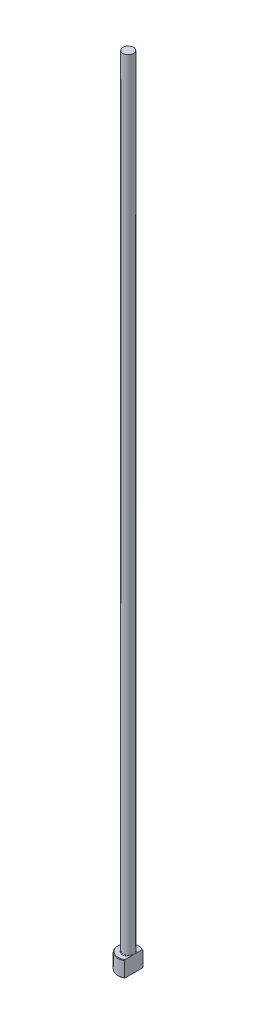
ISO-10303-21;
HEADER;
FILE_DESCRIPTION(('STEP AP214'),'2;1');
FILE_NAME('part.step','',(''),(''),'','','');
FILE_SCHEMA(('AUTOMOTIVE_DESIGN { 1 0 10303 214 1 1 1 1 }'));
ENDSEC;
DATA;
#1=APPLICATION_CONTEXT('core data for automotive mechanical design processes');
#2=APPLICATION_PROTOCOL_DEFINITION('international standard','automotive_design',2000,#1);
#3=PRODUCT_CONTEXT('',#1,'mechanical');
#4=PRODUCT('Part','Part','',(#3));
#5=PRODUCT_RELATED_PRODUCT_CATEGORY('part','',(#4));
#6=PRODUCT_DEFINITION_FORMATION('','',#4);
#7=PRODUCT_DEFINITION_CONTEXT('part definition',#1,'design');
#8=PRODUCT_DEFINITION('design','',#6,#7);
#9=PRODUCT_DEFINITION_SHAPE('','',#8);
#10=(LENGTH_UNIT() NAMED_UNIT(*) SI_UNIT(.MILLI.,.METRE.));
#11=(NAMED_UNIT(*) PLANE_ANGLE_UNIT() SI_UNIT($,.RADIAN.));
#12=(NAMED_UNIT(*) SI_UNIT($,.STERADIAN.) SOLID_ANGLE_UNIT());
#13=UNCERTAINTY_MEASURE_WITH_UNIT(LENGTH_MEASURE(1.E-05),#10,'distance_accuracy_value','');
#14=(GEOMETRIC_REPRESENTATION_CONTEXT(3) GLOBAL_UNCERTAINTY_ASSIGNED_CONTEXT((#13)) GLOBAL_UNIT_ASSIGNED_CONTEXT((#10,
#11,#12)) REPRESENTATION_CONTEXT('',''));
#15=CARTESIAN_POINT('',(0.,0.,0.));
#16=DIRECTION('',(0.,0.,1.));
#17=DIRECTION('',(1.,0.,0.));
#18=AXIS2_PLACEMENT_3D('',#15,#16,#17);
#19=CARTESIAN_POINT('',(0.,0.,0.));
#20=DIRECTION('',(0.,-1.,0.));
#21=DIRECTION('',(0.,0.,-1.));
#22=AXIS2_PLACEMENT_3D('',#19,#20,#21);
#23=PLANE('',#22);
#24=CARTESIAN_POINT('',(0.,0.,0.));
#25=DIRECTION('',(0.,-1.,0.));
#26=DIRECTION('',(0.,0.,-1.));
#27=AXIS2_PLACEMENT_3D('',#24,#25,#26);
#28=CIRCLE('',#27,3.79999999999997);
#29=CARTESIAN_POINT('',(1.99999999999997,0.,3.23109888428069));
#30=VERTEX_POINT('',#29);
#31=CARTESIAN_POINT('',(1.99999999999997,0.,-3.23109888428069));
#32=VERTEX_POINT('',#31);
#33=EDGE_CURVE('E98',#30,#32,#28,.T.);
#34=ORIENTED_EDGE('',*,*,#33,.T.);
#35=DIRECTION('',(0.,0.,1.));
#36=VECTOR('',#35,1.);
#37=CARTESIAN_POINT('',(1.99999999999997,0.,3.46410161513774));
#38=LINE('',#37,#36);
#39=EDGE_CURVE('E83',#32,#30,#38,.T.);
#40=ORIENTED_EDGE('',*,*,#39,.T.);
#41=EDGE_LOOP('',(#34,#40));
#42=FACE_BOUND('',#41,.T.);
#43=ADVANCED_FACE('F32',(#42),#23,.T.);
#44=CARTESIAN_POINT('',(0.,259.958771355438,0.));
#45=DIRECTION('',(0.,1.,0.));
#46=DIRECTION('',(0.,0.,1.));
#47=AXIS2_PLACEMENT_3D('',#44,#45,#46);
#48=CYLINDRICAL_SURFACE('',#47,3.99999999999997);
#49=CARTESIAN_POINT('',(0.,5.80000000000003,0.));
#50=DIRECTION('',(0.,1.,0.));
#51=DIRECTION('',(0.,0.,1.));
#52=AXIS2_PLACEMENT_3D('',#49,#50,#51);
#53=CIRCLE('',#52,3.99999999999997);
#54=CARTESIAN_POINT('',(1.99999999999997,5.80000000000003,3.46410161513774));
#55=VERTEX_POINT('',#54);
#56=CARTESIAN_POINT('',(1.99999999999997,5.80000000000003,-3.46410161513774));
#57=VERTEX_POINT('',#56);
#58=EDGE_CURVE('E104',#55,#57,#53,.F.);
#59=ORIENTED_EDGE('',*,*,#58,.T.);
#60=DIRECTION('',(0.,-1.,0.));
#61=VECTOR('',#60,1.);
#62=CARTESIAN_POINT('',(1.99999999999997,300.,-3.46410161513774));
#63=LINE('',#62,#61);
#64=CARTESIAN_POINT('',(1.99999999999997,0.199999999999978,-3.46410161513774));
#65=VERTEX_POINT('',#64);
#66=EDGE_CURVE('E183',#57,#65,#63,.T.);
#67=ORIENTED_EDGE('',*,*,#66,.T.);
#68=CARTESIAN_POINT('',(0.,0.199999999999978,0.));
#69=DIRECTION('',(0.,-1.,0.));
#70=DIRECTION('',(0.,0.,-1.));
#71=AXIS2_PLACEMENT_3D('',#68,#69,#70);
#72=CIRCLE('',#71,3.99999999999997);
#73=CARTESIAN_POINT('',(1.99999999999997,0.199999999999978,3.46410161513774));
#74=VERTEX_POINT('',#73);
#75=EDGE_CURVE('E100',#65,#74,#72,.F.);
#76=ORIENTED_EDGE('',*,*,#75,.T.);
#77=DIRECTION('',(0.,-1.,0.));
#78=VECTOR('',#77,1.);
#79=CARTESIAN_POINT('',(1.99999999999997,300.,3.46410161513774));
#80=LINE('',#79,#78);
#81=EDGE_CURVE('E93',#55,#74,#80,.T.);
#82=ORIENTED_EDGE('',*,*,#81,.F.);
#83=EDGE_LOOP('',(#59,#67,#76,#82));
#84=FACE_BOUND('',#83,.T.);
#85=ADVANCED_FACE('F158',(#84),#48,.T.);
#86=CARTESIAN_POINT('',(-3.99999999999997,6.,0.));
#87=DIRECTION('',(0.,1.,0.));
#88=DIRECTION('',(0.,0.,1.));
#89=AXIS2_PLACEMENT_3D('',#86,#87,#88);
#90=PLANE('',#89);
#91=CARTESIAN_POINT('',(0.,6.,0.));
#92=DIRECTION('',(0.,1.,0.));
#93=DIRECTION('',(0.,0.,1.));
#94=AXIS2_PLACEMENT_3D('',#91,#92,#93);
#95=CIRCLE('',#94,3.8);
#96=CARTESIAN_POINT('',(1.99999999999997,6.,-3.23109888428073));
#97=VERTEX_POINT('',#96);
#98=CARTESIAN_POINT('',(1.99999999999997,6.,3.23109888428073));
#99=VERTEX_POINT('',#98);
#100=EDGE_CURVE('E178',#97,#99,#95,.T.);
#101=ORIENTED_EDGE('',*,*,#100,.T.);
#102=DIRECTION('',(0.,0.,-1.));
#103=VECTOR('',#102,1.);
#104=CARTESIAN_POINT('',(1.99999999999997,6.,0.));
#105=LINE('',#104,#103);
#106=CARTESIAN_POINT('',(1.99999999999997,5.99999999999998,0.916515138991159));
#107=VERTEX_POINT('',#106);
#108=EDGE_CURVE('E57',#99,#107,#105,.T.);
#109=ORIENTED_EDGE('',*,*,#108,.T.);
#110=CARTESIAN_POINT('',(0.,6.,0.));
#111=DIRECTION('',(0.,1.,0.));
#112=DIRECTION('',(0.,0.,1.));
#113=AXIS2_PLACEMENT_3D('',#110,#111,#112);
#114=CIRCLE('',#113,2.19999999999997);
#115=CARTESIAN_POINT('',(1.99999999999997,5.99999999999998,-0.916515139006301));
#116=VERTEX_POINT('',#115);
#117=EDGE_CURVE('E107',#107,#116,#114,.F.);
#118=ORIENTED_EDGE('',*,*,#117,.T.);
#119=EDGE_CURVE('E136',#116,#97,#105,.T.);
#120=ORIENTED_EDGE('',*,*,#119,.T.);
#121=EDGE_LOOP('',(#101,#109,#118,#120));
#122=FACE_BOUND('',#121,.T.);
#123=ADVANCED_FACE('F147',(#122),#90,.T.);
#124=CARTESIAN_POINT('',(0.,6.00000000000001,0.));
#125=DIRECTION('',(0.,-1.,0.));
#126=DIRECTION('',(0.,0.,-1.));
#127=AXIS2_PLACEMENT_3D('',#124,#125,#126);
#128=CONICAL_SURFACE('',#127,3.8,0.785398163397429);
#129=ORIENTED_EDGE('',*,*,#58,.F.);
#130=CARTESIAN_POINT('',(1.99999999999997,1.91904532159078,7.62295524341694));
#131=CARTESIAN_POINT('',(1.99999999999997,2.08611243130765,7.45022392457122));
#132=CARTESIAN_POINT('',(1.99999999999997,2.25300024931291,7.27731861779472));
#133=CARTESIAN_POINT('',(1.99999999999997,2.58631125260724,6.9310565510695));
#134=CARTESIAN_POINT('',(1.99999999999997,2.752734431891,6.75769978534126));
#135=CARTESIAN_POINT('',(1.99999999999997,3.08509080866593,6.41034692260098));
#136=CARTESIAN_POINT('',(1.99999999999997,3.25102371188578,6.23635054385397));
#137=CARTESIAN_POINT('',(1.99999999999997,3.58215598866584,5.88766284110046));
#138=CARTESIAN_POINT('',(1.99999999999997,3.74735536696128,5.71297152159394));
#139=CARTESIAN_POINT('',(1.99999999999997,4.07353855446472,5.36616839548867));
#140=CARTESIAN_POINT('',(1.99999999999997,4.23454099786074,5.19407412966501));
#141=CARTESIAN_POINT('',(1.99999999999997,4.55534102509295,4.84876663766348));
#142=CARTESIAN_POINT('',(1.99999999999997,4.71513861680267,4.67555341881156));
#143=CARTESIAN_POINT('',(1.99999999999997,5.03306183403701,4.32766569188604));
#144=CARTESIAN_POINT('',(1.99999999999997,5.19118781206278,4.15299150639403));
#145=CARTESIAN_POINT('',(1.99999999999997,5.50513944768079,3.80159134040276));
#146=CARTESIAN_POINT('',(1.99999999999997,5.66096519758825,3.62486544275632));
#147=CARTESIAN_POINT('',(1.99999999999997,5.90974646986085,3.33722425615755));
#148=CARTESIAN_POINT('',(1.99999999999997,6.00376148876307,3.22722645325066));
#149=CARTESIAN_POINT('',(1.99999999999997,6.19011825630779,3.00579987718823));
#150=CARTESIAN_POINT('',(1.99999999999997,6.28245983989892,2.8943709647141));
#151=CARTESIAN_POINT('',(1.99999999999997,6.46586188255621,2.66849662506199));
#152=CARTESIAN_POINT('',(1.99999999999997,6.5568984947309,2.55403176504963));
#153=CARTESIAN_POINT('',(1.99999999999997,6.7357880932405,2.32266819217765));
#154=CARTESIAN_POINT('',(1.99999999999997,6.82364184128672,2.20577007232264));
#155=CARTESIAN_POINT('',(1.99999999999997,6.9961275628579,1.9668870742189));
#156=CARTESIAN_POINT('',(1.99999999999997,7.08069035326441,1.84485190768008));
#157=CARTESIAN_POINT('',(1.99999999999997,7.24300264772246,1.59599329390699));
#158=CARTESIAN_POINT('',(1.99999999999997,7.32074277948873,1.46916359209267));
#159=CARTESIAN_POINT('',(1.99999999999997,7.4286976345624,1.27510066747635));
#160=CARTESIAN_POINT('',(1.99999999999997,7.46305374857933,1.21018943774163));
#161=CARTESIAN_POINT('',(1.99999999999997,7.5283714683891,1.07868835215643));
#162=CARTESIAN_POINT('',(1.99999999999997,7.55933245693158,1.01209819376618));
#163=CARTESIAN_POINT('',(1.99999999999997,7.64566860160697,0.809894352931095));
#164=CARTESIAN_POINT('',(1.99999999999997,7.6947821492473,0.671360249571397));
#165=CARTESIAN_POINT('',(1.99999999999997,7.74794829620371,0.463657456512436));
#166=CARTESIAN_POINT('',(1.99999999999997,7.76205065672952,0.397033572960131));
#167=CARTESIAN_POINT('',(1.99999999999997,7.78390371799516,0.262728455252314));
#168=CARTESIAN_POINT('',(1.99999999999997,7.79165498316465,0.195047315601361));
#169=CARTESIAN_POINT('',(1.99999999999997,7.8002569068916,0.0594528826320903));
#170=CARTESIAN_POINT('',(1.99999999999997,7.80112894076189,-0.00845903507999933));
#171=CARTESIAN_POINT('',(1.99999999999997,7.79596585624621,-0.144020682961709));
#172=CARTESIAN_POINT('',(1.99999999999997,7.78993016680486,-0.211670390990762));
#173=CARTESIAN_POINT('',(1.99999999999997,7.77145363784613,-0.345483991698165));
#174=CARTESIAN_POINT('',(1.99999999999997,7.75906777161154,-0.41165563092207));
#175=CARTESIAN_POINT('',(1.99999999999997,7.72866360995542,-0.542678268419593));
#176=CARTESIAN_POINT('',(1.99999999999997,7.71064463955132,-0.607529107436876));
#177=CARTESIAN_POINT('',(1.99999999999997,7.66972939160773,-0.73606439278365));
#178=CARTESIAN_POINT('',(1.99999999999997,7.64680564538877,-0.799739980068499));
#179=CARTESIAN_POINT('',(1.99999999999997,7.59700147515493,-0.925489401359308));
#180=CARTESIAN_POINT('',(1.99999999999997,7.57012185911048,-0.987563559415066));
#181=CARTESIAN_POINT('',(1.99999999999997,7.48443518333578,-1.17209020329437));
#182=CARTESIAN_POINT('',(1.99999999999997,7.42077407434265,-1.29228210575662));
#183=CARTESIAN_POINT('',(1.99999999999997,7.2850264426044,-1.52785770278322));
#184=CARTESIAN_POINT('',(1.99999999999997,7.21292931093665,-1.64323509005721));
#185=CARTESIAN_POINT('',(1.99999999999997,7.06281517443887,-1.87069387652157));
#186=CARTESIAN_POINT('',(1.99999999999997,6.98477595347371,-1.98276048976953));
#187=CARTESIAN_POINT('',(1.99999999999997,6.8248197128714,-2.20397837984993));
#188=CARTESIAN_POINT('',(1.99999999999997,6.74290465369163,-2.31313108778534));
#189=CARTESIAN_POINT('',(1.99999999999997,6.57517222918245,-2.53068545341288));
#190=CARTESIAN_POINT('',(1.99999999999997,6.48931769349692,-2.63905831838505));
#191=CARTESIAN_POINT('',(1.99999999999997,6.31548151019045,-2.85409686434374));
#192=CARTESIAN_POINT('',(1.99999999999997,6.2274996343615,-2.96076236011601));
#193=CARTESIAN_POINT('',(1.99999999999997,6.05015030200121,-3.17249211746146));
#194=CARTESIAN_POINT('',(1.99999999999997,5.9607867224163,-3.27755963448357));
#195=CARTESIAN_POINT('',(1.99999999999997,5.78082366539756,-3.4866319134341));
#196=CARTESIAN_POINT('',(1.99999999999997,5.69022416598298,-3.59063665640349));
#197=CARTESIAN_POINT('',(1.99999999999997,5.44796733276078,-3.86612439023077));
#198=CARTESIAN_POINT('',(1.99999999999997,5.29545972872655,-4.03685912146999));
#199=CARTESIAN_POINT('',(1.99999999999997,4.98858070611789,-4.37664803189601));
#200=CARTESIAN_POINT('',(1.99999999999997,4.83420923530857,-4.54570216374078));
#201=CARTESIAN_POINT('',(1.99999999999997,4.52396102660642,-4.88271638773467));
#202=CARTESIAN_POINT('',(1.99999999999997,4.36808300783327,-5.05067529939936));
#203=CARTESIAN_POINT('',(1.99999999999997,4.05530513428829,-5.38563883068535));
#204=CARTESIAN_POINT('',(1.99999999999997,3.89840527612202,-5.55264344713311));
#205=CARTESIAN_POINT('',(1.99999999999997,3.59029018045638,-5.87905385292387));
#206=CARTESIAN_POINT('',(1.99999999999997,3.43910664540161,-6.03848959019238));
#207=CARTESIAN_POINT('',(1.99999999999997,3.1361643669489,-6.35681456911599));
#208=CARTESIAN_POINT('',(1.99999999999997,2.98440562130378,-6.51570380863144));
#209=CARTESIAN_POINT('',(1.99999999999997,2.6805950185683,-6.83286192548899));
#210=CARTESIAN_POINT('',(1.99999999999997,2.52854367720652,-6.99113129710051));
#211=CARTESIAN_POINT('',(1.99999999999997,2.22406035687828,-7.30730102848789));
#212=CARTESIAN_POINT('',(1.99999999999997,2.07162838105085,-7.46520139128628));
#213=CARTESIAN_POINT('',(1.99999999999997,1.91904532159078,-7.62295524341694));
#214=B_SPLINE_CURVE_WITH_KNOTS('',3,(#130,#131,#132,#133,#134,#135,#136,#137,#138,#139,#140,
#141,#142,#143,#144,#145,#146,#147,#148,#149,#150,#151,#152,#153,#154,#155,#156,#157,#158,#159,
#160,#161,#162,#163,#164,#165,#166,#167,#168,#169,#170,#171,#172,#173,#174,#175,#176,#177,#178,
#179,#180,#181,#182,#183,#184,#185,#186,#187,#188,#189,#190,#191,#192,#193,#194,#195,#196,#197,
#198,#199,#200,#201,#202,#203,#204,#205,#206,#207,#208,#209,#210,#211,#212,#213),.UNSPECIFIED.,
.F.,.F.,(4,2,2,2,2,2,2,2,2,2,2,2,2,2,2,2,2,2,2,2,2,2,2,2,2,2,2,2,2,2,2,2,2,2,2,2,2,2,2,2,2,4),
(0.,0.720921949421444,1.44185317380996,2.16315326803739,2.88444869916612,3.59144103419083,
4.29842874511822,5.00526427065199,5.71207135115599,6.14616174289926,6.58029471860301,
7.01901494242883,7.45762947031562,7.90290456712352,8.3487820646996,8.56901415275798,
8.78928621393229,9.22814472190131,9.43219512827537,9.63622739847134,9.8396254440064,
10.0430403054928,10.2447232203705,10.4464303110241,10.6492980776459,10.8521244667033,
11.259558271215,11.6675100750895,12.0770700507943,12.4864250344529,12.901167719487,
13.3159550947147,13.7297367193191,14.1435257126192,14.8302935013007,15.5170805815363,
16.2045145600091,16.8919508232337,17.5511045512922,18.2102608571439,18.86868195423,
19.5270976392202),.UNSPECIFIED.);
#215=EDGE_CURVE('E135',#55,#99,#214,.T.);
#216=ORIENTED_EDGE('',*,*,#215,.T.);
#217=ORIENTED_EDGE('',*,*,#100,.F.);
#218=EDGE_CURVE('E127',#97,#57,#214,.T.);
#219=ORIENTED_EDGE('',*,*,#218,.T.);
#220=EDGE_LOOP('',(#129,#216,#217,#219));
#221=FACE_BOUND('',#220,.T.);
#222=ADVANCED_FACE('F143',(#221),#128,.T.);
#223=CARTESIAN_POINT('',(0.,0.199999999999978,0.));
#224=DIRECTION('',(0.,1.,0.));
#225=DIRECTION('',(0.,0.,1.));
#226=AXIS2_PLACEMENT_3D('',#223,#224,#225);
#227=CONICAL_SURFACE('',#226,3.99999999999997,0.785398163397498);
#228=ORIENTED_EDGE('',*,*,#75,.F.);
#229=CARTESIAN_POINT('',(1.99999999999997,4.08095467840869,-7.62295524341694));
#230=CARTESIAN_POINT('',(1.99999999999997,3.91388756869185,-7.45022392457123));
#231=CARTESIAN_POINT('',(1.99999999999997,3.74699975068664,-7.27731861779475));
#232=CARTESIAN_POINT('',(1.99999999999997,3.41368874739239,-6.93105655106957));
#233=CARTESIAN_POINT('',(1.99999999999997,3.24726556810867,-6.75769978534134));
#234=CARTESIAN_POINT('',(1.99999999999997,2.91490919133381,-6.4103469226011));
#235=CARTESIAN_POINT('',(1.99999999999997,2.748976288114,-6.23635054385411));
#236=CARTESIAN_POINT('',(1.99999999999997,2.41784401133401,-5.88766284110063));
#237=CARTESIAN_POINT('',(1.99999999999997,2.25264463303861,-5.71297152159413));
#238=CARTESIAN_POINT('',(1.99999999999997,1.92646144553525,-5.36616839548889));
#239=CARTESIAN_POINT('',(1.99999999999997,1.76545900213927,-5.19407412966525));
#240=CARTESIAN_POINT('',(1.99999999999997,1.44465897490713,-4.84876663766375));
#241=CARTESIAN_POINT('',(1.99999999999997,1.28486138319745,-4.67555341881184));
#242=CARTESIAN_POINT('',(1.99999999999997,0.966938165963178,-4.32766569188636));
#243=CARTESIAN_POINT('',(1.99999999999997,0.80881218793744,-4.15299150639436));
#244=CARTESIAN_POINT('',(1.99999999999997,0.494860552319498,-3.80159134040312));
#245=CARTESIAN_POINT('',(1.99999999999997,0.339034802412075,-3.62486544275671));
#246=CARTESIAN_POINT('',(1.99999999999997,0.0902535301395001,-3.33722425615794));
#247=CARTESIAN_POINT('',(1.99999999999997,-0.00376148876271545,-3.22722645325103));
#248=CARTESIAN_POINT('',(1.99999999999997,-0.190118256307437,-3.00579987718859));
#249=CARTESIAN_POINT('',(1.99999999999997,-0.282459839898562,-2.89437096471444));
#250=CARTESIAN_POINT('',(1.99999999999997,-0.465861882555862,-2.66849662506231));
#251=CARTESIAN_POINT('',(1.99999999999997,-0.556898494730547,-2.55403176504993));
#252=CARTESIAN_POINT('',(1.99999999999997,-0.73578809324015,-2.32266819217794));
#253=CARTESIAN_POINT('',(1.99999999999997,-0.823641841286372,-2.20577007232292));
#254=CARTESIAN_POINT('',(1.99999999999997,-0.996127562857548,-1.96688707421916));
#255=CARTESIAN_POINT('',(1.99999999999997,-1.08069035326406,-1.84485190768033));
#256=CARTESIAN_POINT('',(1.99999999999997,-1.24300264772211,-1.59599329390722));
#257=CARTESIAN_POINT('',(1.99999999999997,-1.32074277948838,-1.46916359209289));
#258=CARTESIAN_POINT('',(1.99999999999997,-1.42869763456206,-1.27510066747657));
#259=CARTESIAN_POINT('',(1.99999999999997,-1.46305374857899,-1.21018943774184));
#260=CARTESIAN_POINT('',(1.99999999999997,-1.52837146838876,-1.07868835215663));
#261=CARTESIAN_POINT('',(1.99999999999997,-1.55933245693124,-1.01209819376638));
#262=CARTESIAN_POINT('',(1.99999999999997,-1.64566860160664,-0.809894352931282));
#263=CARTESIAN_POINT('',(1.99999999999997,-1.69478214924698,-0.671360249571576));
#264=CARTESIAN_POINT('',(1.99999999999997,-1.7479482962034,-0.463657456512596));
#265=CARTESIAN_POINT('',(1.99999999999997,-1.76205065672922,-0.397033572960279));
#266=CARTESIAN_POINT('',(1.99999999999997,-1.78390371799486,-0.262728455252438));
#267=CARTESIAN_POINT('',(1.99999999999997,-1.79165498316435,-0.195047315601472));
#268=CARTESIAN_POINT('',(1.99999999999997,-1.80025690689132,-0.0594528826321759));
#269=CARTESIAN_POINT('',(1.99999999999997,-1.8011289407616,0.00845903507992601));
#270=CARTESIAN_POINT('',(1.99999999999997,-1.79596585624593,0.144020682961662));
#271=CARTESIAN_POINT('',(1.99999999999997,-1.78993016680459,0.211670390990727));
#272=CARTESIAN_POINT('',(1.99999999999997,-1.77145363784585,0.345483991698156));
#273=CARTESIAN_POINT('',(1.99999999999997,-1.75906777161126,0.411655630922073));
#274=CARTESIAN_POINT('',(1.99999999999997,-1.72866360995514,0.542678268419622));
#275=CARTESIAN_POINT('',(1.99999999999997,-1.71064463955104,0.607529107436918));
#276=CARTESIAN_POINT('',(1.99999999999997,-1.66972939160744,0.736064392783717));
#277=CARTESIAN_POINT('',(1.99999999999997,-1.64680564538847,0.79973998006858));
#278=CARTESIAN_POINT('',(1.99999999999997,-1.59700147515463,0.925489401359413));
#279=CARTESIAN_POINT('',(1.99999999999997,-1.57012185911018,0.987563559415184));
#280=CARTESIAN_POINT('',(1.99999999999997,-1.48443518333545,1.17209020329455));
#281=CARTESIAN_POINT('',(1.99999999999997,-1.4207740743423,1.29228210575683));
#282=CARTESIAN_POINT('',(1.99999999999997,-1.28502644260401,1.52785770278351));
#283=CARTESIAN_POINT('',(1.99999999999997,-1.21292931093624,1.64323509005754));
#284=CARTESIAN_POINT('',(1.99999999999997,-1.06281517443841,1.87069387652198));
#285=CARTESIAN_POINT('',(1.99999999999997,-0.984775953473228,1.98276048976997));
#286=CARTESIAN_POINT('',(1.99999999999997,-0.82481971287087,2.20397837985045));
#287=CARTESIAN_POINT('',(1.99999999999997,-0.742904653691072,2.3131310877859));
#288=CARTESIAN_POINT('',(1.99999999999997,-0.57517222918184,2.53068545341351));
#289=CARTESIAN_POINT('',(1.99999999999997,-0.489317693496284,2.63905831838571));
#290=CARTESIAN_POINT('',(1.99999999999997,-0.315481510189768,2.85409686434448));
#291=CARTESIAN_POINT('',(1.99999999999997,-0.227499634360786,2.96076236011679));
#292=CARTESIAN_POINT('',(1.99999999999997,-0.0501503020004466,3.17249211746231));
#293=CARTESIAN_POINT('',(1.99999999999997,0.0392132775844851,3.27755963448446));
#294=CARTESIAN_POINT('',(1.99999999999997,0.219176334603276,3.48663191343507));
#295=CARTESIAN_POINT('',(1.99999999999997,0.309775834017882,3.59063665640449));
#296=CARTESIAN_POINT('',(1.99999999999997,0.552032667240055,3.86612439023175));
#297=CARTESIAN_POINT('',(1.99999999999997,0.704540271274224,4.03685912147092));
#298=CARTESIAN_POINT('',(1.99999999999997,1.01141929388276,4.37664803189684));
#299=CARTESIAN_POINT('',(1.99999999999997,1.16579076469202,4.54570216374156));
#300=CARTESIAN_POINT('',(1.99999999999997,1.47603897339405,4.88271638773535));
#301=CARTESIAN_POINT('',(1.99999999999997,1.63191699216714,5.0506752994));
#302=CARTESIAN_POINT('',(1.99999999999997,1.94469486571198,5.3856388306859));
#303=CARTESIAN_POINT('',(1.99999999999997,2.10159472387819,5.55264344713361));
#304=CARTESIAN_POINT('',(1.99999999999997,2.40970981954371,5.87905385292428));
#305=CARTESIAN_POINT('',(1.99999999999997,2.56089335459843,6.03848959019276));
#306=CARTESIAN_POINT('',(1.99999999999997,2.86383563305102,6.35681456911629));
#307=CARTESIAN_POINT('',(1.99999999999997,3.01559437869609,6.5157038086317));
#308=CARTESIAN_POINT('',(1.99999999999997,3.31940498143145,6.83286192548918));
#309=CARTESIAN_POINT('',(1.99999999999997,3.47145632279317,6.99113129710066));
#310=CARTESIAN_POINT('',(1.99999999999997,3.77593964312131,7.30730102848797));
#311=CARTESIAN_POINT('',(1.99999999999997,3.92837161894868,7.46520139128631));
#312=CARTESIAN_POINT('',(1.99999999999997,4.08095467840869,7.62295524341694));
#313=B_SPLINE_CURVE_WITH_KNOTS('',3,(#229,#230,#231,#232,#233,#234,#235,#236,#237,#238,#239,
#240,#241,#242,#243,#244,#245,#246,#247,#248,#249,#250,#251,#252,#253,#254,#255,#256,#257,#258,
#259,#260,#261,#262,#263,#264,#265,#266,#267,#268,#269,#270,#271,#272,#273,#274,#275,#276,#277,
#278,#279,#280,#281,#282,#283,#284,#285,#286,#287,#288,#289,#290,#291,#292,#293,#294,#295,#296,
#297,#298,#299,#300,#301,#302,#303,#304,#305,#306,#307,#308,#309,#310,#311,#312),.UNSPECIFIED.,
.F.,.F.,(4,2,2,2,2,2,2,2,2,2,2,2,2,2,2,2,2,2,2,2,2,2,2,2,2,2,2,2,2,2,2,2,2,2,2,2,2,2,2,2,2,4),
(0.,0.720921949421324,1.44185317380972,2.16315326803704,2.88444869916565,3.59144103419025,
4.29842874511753,5.0052642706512,5.71207135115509,6.14616174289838,6.58029471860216,
7.01901494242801,7.45762947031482,7.90290456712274,8.34878206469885,8.56901415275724,
8.78928621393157,9.22814472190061,9.43219512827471,9.63622739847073,9.83962544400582,
10.0430403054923,10.24472322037,10.4464303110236,10.6492980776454,10.852124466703,
11.2595582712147,11.6675100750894,12.0770700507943,12.4864250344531,12.9011677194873,
13.3159550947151,13.7297367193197,14.1435257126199,14.8302935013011,15.5170805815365,
16.204514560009,16.8919508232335,17.5511045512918,18.2102608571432,18.8686819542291,
19.5270976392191),.UNSPECIFIED.);
#314=EDGE_CURVE('E86',#65,#32,#313,.T.);
#315=ORIENTED_EDGE('',*,*,#314,.T.);
#316=ORIENTED_EDGE('',*,*,#33,.F.);
#317=EDGE_CURVE('E89',#30,#74,#313,.T.);
#318=ORIENTED_EDGE('',*,*,#317,.T.);
#319=EDGE_LOOP('',(#228,#315,#316,#318));
#320=FACE_BOUND('',#319,.T.);
#321=ADVANCED_FACE('F97',(#320),#227,.T.);
#322=CARTESIAN_POINT('',(0.,6.19999999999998,0.));
#323=DIRECTION('',(0.,1.,0.));
#324=DIRECTION('',(0.,0.,1.));
#325=AXIS2_PLACEMENT_3D('',#322,#323,#324);
#326=TOROIDAL_SURFACE('',#325,2.19999999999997,0.2);
#327=CARTESIAN_POINT('',(1.99999999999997,6.19999999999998,0.));
#328=CARTESIAN_POINT('',(1.99999999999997,6.20000050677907,1.13930141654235E-10));
#329=CARTESIAN_POINT('',(1.99999999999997,6.20000101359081,-1.46766795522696E-07));
#330=CARTESIAN_POINT('',(1.99999999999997,6.20000197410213,-5.82067451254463E-07));
#331=CARTESIAN_POINT('',(1.99999999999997,6.20000242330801,-8.77873018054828E-07));
#332=CARTESIAN_POINT('',(1.99999999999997,6.2000033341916,-1.5842451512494E-06));
#333=CARTESIAN_POINT('',(1.99999999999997,6.20000378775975,-2.00534283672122E-06));
#334=CARTESIAN_POINT('',(1.99999999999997,6.20000462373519,-2.89558841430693E-06));
#335=CARTESIAN_POINT('',(1.99999999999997,6.20000500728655,-3.36372325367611E-06));
#336=CARTESIAN_POINT('',(1.99999999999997,6.20000636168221,-5.10887550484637E-06));
#337=CARTESIAN_POINT('',(1.99999999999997,6.20000725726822,-6.44597279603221E-06));
#338=CARTESIAN_POINT('',(1.99999999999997,6.20000879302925,-9.14926716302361E-06));
#339=CARTESIAN_POINT('',(1.99999999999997,6.20000944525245,-1.0508971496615E-05));
#340=CARTESIAN_POINT('',(1.99999999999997,6.20001204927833,-1.60555880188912E-05));
#341=CARTESIAN_POINT('',(1.99999999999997,6.20001390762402,-2.02908747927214E-05));
#342=CARTESIAN_POINT('',(1.99999999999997,6.20001676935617,-2.84438494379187E-05));
#343=CARTESIAN_POINT('',(1.99999999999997,6.20001785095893,-3.23343259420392E-05));
#344=CARTESIAN_POINT('',(1.99999999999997,6.20002551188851,-6.06027145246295E-05));
#345=CARTESIAN_POINT('',(1.99999999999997,6.20003111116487,-8.51991847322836E-05));
#346=CARTESIAN_POINT('',(1.99999999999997,6.20005559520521,-0.00018156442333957));
#347=CARTESIAN_POINT('',(1.99999999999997,6.20007914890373,-0.000252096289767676));
#348=CARTESIAN_POINT('',(1.99999999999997,6.20017002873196,-0.00052958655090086));
#349=CARTESIAN_POINT('',(1.99999999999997,6.20023415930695,-0.00073729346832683));
#350=CARTESIAN_POINT('',(1.99999999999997,6.20048926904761,-0.00155657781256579));
#351=CARTESIAN_POINT('',(1.99999999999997,6.20068414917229,-0.00216722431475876));
#352=CARTESIAN_POINT('',(1.99999999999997,6.20148805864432,-0.0046938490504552));
#353=CARTESIAN_POINT('',(1.99999999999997,6.20209226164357,-0.00661098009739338));
#354=CARTESIAN_POINT('',(1.99999999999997,6.20822779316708,-0.026069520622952));
#355=CARTESIAN_POINT('',(1.99999999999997,6.21378174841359,-0.0436057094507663));
#356=CARTESIAN_POINT('',(1.99999999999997,6.22462834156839,-0.0780127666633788));
#357=CARTESIAN_POINT('',(1.99999999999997,6.22992277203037,-0.0948831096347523));
#358=CARTESIAN_POINT('',(1.99999999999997,6.24110477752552,-0.130713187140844));
#359=CARTESIAN_POINT('',(1.99999999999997,6.24698536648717,-0.149675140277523));
#360=CARTESIAN_POINT('',(1.99999999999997,6.25869835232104,-0.187834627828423));
#361=CARTESIAN_POINT('',(1.99999999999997,6.26452957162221,-0.207032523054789));
#362=CARTESIAN_POINT('',(1.99999999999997,6.27861584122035,-0.254071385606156));
#363=CARTESIAN_POINT('',(1.99999999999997,6.28678835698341,-0.281937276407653));
#364=CARTESIAN_POINT('',(1.99999999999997,6.30249503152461,-0.33711523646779));
#365=CARTESIAN_POINT('',(1.99999999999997,6.31003989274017,-0.364424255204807));
#366=CARTESIAN_POINT('',(1.99999999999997,6.32554795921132,-0.422841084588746));
#367=CARTESIAN_POINT('',(1.99999999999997,6.33343288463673,-0.453970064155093));
#368=CARTESIAN_POINT('',(1.99999999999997,6.34833120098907,-0.516667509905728));
#369=CARTESIAN_POINT('',(1.99999999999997,6.3553379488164,-0.548237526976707));
#370=CARTESIAN_POINT('',(1.99999999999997,6.37554978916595,-0.647984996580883));
#371=CARTESIAN_POINT('',(1.99999999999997,6.38665117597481,-0.716635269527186));
#372=CARTESIAN_POINT('',(1.99999999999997,6.39785773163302,-0.8324457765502));
#373=CARTESIAN_POINT('',(1.99999999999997,6.40036304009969,-0.879345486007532));
#374=CARTESIAN_POINT('',(1.99999999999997,6.39976024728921,-0.949238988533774));
#375=CARTESIAN_POINT('',(1.99999999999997,6.39886048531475,-0.97224857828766));
#376=CARTESIAN_POINT('',(1.99999999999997,6.39534463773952,-1.01812773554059));
#377=CARTESIAN_POINT('',(1.99999999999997,6.39273014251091,-1.04099741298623));
#378=CARTESIAN_POINT('',(1.99999999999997,6.38623968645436,-1.08102660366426));
#379=CARTESIAN_POINT('',(1.99999999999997,6.38280841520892,-1.09825717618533));
#380=CARTESIAN_POINT('',(1.99999999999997,6.37442567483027,-1.13243508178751));
#381=CARTESIAN_POINT('',(1.99999999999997,6.36946777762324,-1.14938089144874));
#382=CARTESIAN_POINT('',(1.99999999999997,6.35764172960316,-1.18276398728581));
#383=CARTESIAN_POINT('',(1.99999999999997,6.35075810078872,-1.1991959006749));
#384=CARTESIAN_POINT('',(1.99999999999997,6.33462082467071,-1.23083581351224));
#385=CARTESIAN_POINT('',(1.99999999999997,6.32537783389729,-1.24604892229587));
#386=CARTESIAN_POINT('',(1.99999999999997,6.30929159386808,-1.26715296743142));
#387=CARTESIAN_POINT('',(1.99999999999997,6.303567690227,-1.27389441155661));
#388=CARTESIAN_POINT('',(1.99999999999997,6.29128925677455,-1.28659894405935));
#389=CARTESIAN_POINT('',(1.99999999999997,6.28473413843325,-1.29256147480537));
#390=CARTESIAN_POINT('',(1.99999999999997,6.27066594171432,-1.30346436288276));
#391=CARTESIAN_POINT('',(1.99999999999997,6.26314132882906,-1.30839014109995));
#392=CARTESIAN_POINT('',(1.99999999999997,6.24727957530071,-1.31668687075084));
#393=CARTESIAN_POINT('',(1.99999999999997,6.23894498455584,-1.32006252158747));
#394=CARTESIAN_POINT('',(1.99999999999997,6.22424089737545,-1.3241557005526));
#395=CARTESIAN_POINT('',(1.99999999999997,6.21800630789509,-1.32536112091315));
#396=CARTESIAN_POINT('',(1.99999999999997,6.20542266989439,-1.32669615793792));
#397=CARTESIAN_POINT('',(1.99999999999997,6.19907368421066,-1.32682634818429));
#398=CARTESIAN_POINT('',(1.99999999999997,6.18645152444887,-1.32599950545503));
#399=CARTESIAN_POINT('',(1.99999999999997,6.18017831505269,-1.32504300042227));
#400=CARTESIAN_POINT('',(1.99999999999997,6.16787181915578,-1.32212308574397));
#401=CARTESIAN_POINT('',(1.99999999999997,6.16183869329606,-1.32015901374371));
#402=CARTESIAN_POINT('',(1.99999999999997,6.14844260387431,-1.31466566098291));
#403=CARTESIAN_POINT('',(1.99999999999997,6.14119825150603,-1.3108482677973));
#404=CARTESIAN_POINT('',(1.99999999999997,6.12742328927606,-1.30209252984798));
#405=CARTESIAN_POINT('',(1.99999999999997,6.12089414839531,-1.29715193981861));
#406=CARTESIAN_POINT('',(1.99999999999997,6.10554761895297,-1.28382084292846));
#407=CARTESIAN_POINT('',(1.99999999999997,6.09717242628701,-1.27492468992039));
#408=CARTESIAN_POINT('',(1.99999999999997,6.08188323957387,-1.25597903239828));
#409=CARTESIAN_POINT('',(1.99999999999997,6.07497120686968,-1.24592800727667));
#410=CARTESIAN_POINT('',(1.99999999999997,6.05771073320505,-1.21734573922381));
#411=CARTESIAN_POINT('',(1.99999999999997,6.04862251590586,-1.19806017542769));
#412=CARTESIAN_POINT('',(1.99999999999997,6.03323781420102,-1.15830155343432));
#413=CARTESIAN_POINT('',(1.99999999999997,6.02696471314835,-1.13782009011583));
#414=CARTESIAN_POINT('',(1.99999999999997,6.01659159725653,-1.09607450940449));
#415=CARTESIAN_POINT('',(1.99999999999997,6.01251776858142,-1.07480405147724));
#416=CARTESIAN_POINT('',(1.99999999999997,6.0061890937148,-1.03196822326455));
#417=CARTESIAN_POINT('',(1.99999999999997,6.00393768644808,-1.0104023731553));
#418=CARTESIAN_POINT('',(1.99999999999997,5.99950887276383,-0.946948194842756));
#419=CARTESIAN_POINT('',(1.99999999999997,5.99937097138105,-0.904921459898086));
#420=CARTESIAN_POINT('',(1.99999999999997,6.00391139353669,-0.800067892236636));
#421=CARTESIAN_POINT('',(1.99999999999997,6.01103947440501,-0.737378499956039));
#422=CARTESIAN_POINT('',(1.99999999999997,6.0310998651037,-0.61144432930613));
#423=CARTESIAN_POINT('',(1.99999999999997,6.04417074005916,-0.54822386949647));
#424=CARTESIAN_POINT('',(1.99999999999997,6.06920011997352,-0.442888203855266));
#425=CARTESIAN_POINT('',(1.99999999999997,6.08016343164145,-0.400527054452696));
#426=CARTESIAN_POINT('',(1.99999999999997,6.10315303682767,-0.316588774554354));
#427=CARTESIAN_POINT('',(1.99999999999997,6.11516655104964,-0.275008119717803));
#428=CARTESIAN_POINT('',(1.99999999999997,6.13853403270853,-0.196672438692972));
#429=CARTESIAN_POINT('',(1.99999999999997,6.14981294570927,-0.159894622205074));
#430=CARTESIAN_POINT('',(1.99999999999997,6.17316886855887,-0.0849211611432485));
#431=CARTESIAN_POINT('',(1.99999999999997,6.18525959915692,-0.046729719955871));
#432=CARTESIAN_POINT('',(1.99999999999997,6.1979086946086,-0.00660765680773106));
#433=CARTESIAN_POINT('',(1.99999999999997,6.19851400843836,-0.00468723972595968));
#434=CARTESIAN_POINT('',(1.99999999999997,6.199318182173,-0.00215985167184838));
#435=CARTESIAN_POINT('',(1.99999999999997,6.19951225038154,-0.0015517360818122));
#436=CARTESIAN_POINT('',(1.99999999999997,6.19976637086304,-0.000735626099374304));
#437=CARTESIAN_POINT('',(1.99999999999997,6.19983030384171,-0.000528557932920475));
#438=CARTESIAN_POINT('',(1.99999999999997,6.19992094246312,-0.00025181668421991));
#439=CARTESIAN_POINT('',(1.99999999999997,6.1999444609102,-0.000181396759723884));
#440=CARTESIAN_POINT('',(1.99999999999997,6.19996891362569,-8.51622338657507E-05));
#441=CARTESIAN_POINT('',(1.99999999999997,6.19997450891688,-6.05824645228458E-05));
#442=CARTESIAN_POINT('',(1.99999999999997,6.19998216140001,-3.23308902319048E-05));
#443=CARTESIAN_POINT('',(1.99999999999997,6.19998324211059,-2.8441435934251E-05));
#444=CARTESIAN_POINT('',(1.99999999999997,6.19998610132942,-2.02904710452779E-05));
#445=CARTESIAN_POINT('',(1.99999999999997,6.19998795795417,-1.6056119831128E-05));
#446=CARTESIAN_POINT('',(1.99999999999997,6.19999055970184,-1.05104411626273E-05));
#447=CARTESIAN_POINT('',(1.99999999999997,6.19999121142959,-9.15081317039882E-06));
#448=CARTESIAN_POINT('',(1.99999999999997,6.19999274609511,-6.44758195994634E-06));
#449=CARTESIAN_POINT('',(1.99999999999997,6.19999364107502,-5.11046373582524E-06));
#450=CARTESIAN_POINT('',(1.99999999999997,6.1999949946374,-3.36517635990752E-06));
#451=CARTESIAN_POINT('',(1.99999999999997,6.19999537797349,-2.8969795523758E-06));
#452=CARTESIAN_POINT('',(1.99999999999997,6.19999621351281,-2.00657125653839E-06));
#453=CARTESIAN_POINT('',(1.99999999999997,6.19999666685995,-1.58537196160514E-06));
#454=CARTESIAN_POINT('',(1.99999999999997,6.19999757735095,-8.78757217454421E-07));
#455=CARTESIAN_POINT('',(1.99999999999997,6.19999802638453,-5.82817893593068E-07));
#456=CARTESIAN_POINT('',(1.99999999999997,6.19999898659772,-1.47186735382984E-07));
#457=CARTESIAN_POINT('',(1.99999999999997,6.19999949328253,-1.13916285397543E-10));
#458=CARTESIAN_POINT('',(1.99999999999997,6.19999999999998,0.));
#459=B_SPLINE_CURVE_WITH_KNOTS('',3,(#327,#328,#329,#330,#331,#332,#333,#334,#335,#336,#337,
#338,#339,#340,#341,#342,#343,#344,#345,#346,#347,#348,#349,#350,#351,#352,#353,#354,#355,#356,
#357,#358,#359,#360,#361,#362,#363,#364,#365,#366,#367,#368,#369,#370,#371,#372,#373,#374,#375,
#376,#377,#378,#379,#380,#381,#382,#383,#384,#385,#386,#387,#388,#389,#390,#391,#392,#393,#394,
#395,#396,#397,#398,#399,#400,#401,#402,#403,#404,#405,#406,#407,#408,#409,#410,#411,#412,#413,
#414,#415,#416,#417,#418,#419,#420,#421,#422,#423,#424,#425,#426,#427,#428,#429,#430,#431,#432,
#433,#434,#435,#436,#437,#438,#439,#440,#441,#442,#443,#444,#445,#446,#447,#448,#449,#450,#451,
#452,#453,#454,#455,#456,#457,#458),.UNSPECIFIED.,.T.,.F.,(4,2,2,2,2,2,2,2,2,2,2,2,2,2,2,2,2,2,
2,2,2,2,2,2,2,2,2,2,2,2,2,2,2,2,2,2,2,2,2,2,2,2,2,2,2,2,2,2,2,2,2,2,2,2,2,2,2,2,2,2,2,2,2,2,2,
4),(0.,1.5236988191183E-06,3.13175174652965E-06,4.9793386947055E-06,6.79332712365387E-06,
1.16005918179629E-05,1.61211188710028E-05,2.99630983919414E-05,4.20611839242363E-05,
0.000117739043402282,0.000340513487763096,0.000992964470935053,0.00291555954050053,
0.00894623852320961,0.0641278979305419,0.117173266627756,0.176731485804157,0.23692308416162,
0.324038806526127,0.409031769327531,0.505353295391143,0.602364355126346,0.810598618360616,
0.951214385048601,1.02024793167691,1.08921754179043,1.14187257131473,1.19475241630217,
1.24807013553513,1.30115116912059,1.32762610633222,1.35411989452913,1.38096446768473,
1.40772711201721,1.42669285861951,1.44564848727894,1.46459491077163,1.48355380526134,
1.50798338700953,1.53246223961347,1.56891061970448,1.60540755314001,1.6690093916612,
1.73313017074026,1.79799846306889,1.86298887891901,1.9887768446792,2.17764082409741,
2.37115413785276,2.50240556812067,2.63223743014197,2.74764208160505,2.86781494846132,
2.87385601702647,2.8757706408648,2.87642108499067,2.87664350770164,2.87671913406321,
2.87673122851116,2.87674506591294,2.87674958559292,2.87675439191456,2.87675620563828,
2.87675805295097,2.87675966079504,2.87676118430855),.UNSPECIFIED.);
#460=CARTESIAN_POINT('',(1.99999999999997,6.19999999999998,0.));
#461=VERTEX_POINT('',#460);
#462=EDGE_CURVE('E11',#116,#461,#459,.T.);
#463=ORIENTED_EDGE('',*,*,#462,.F.);
#464=ORIENTED_EDGE('',*,*,#117,.F.);
#465=CARTESIAN_POINT('',(1.99999999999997,6.19999999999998,0.));
#466=CARTESIAN_POINT('',(1.99999999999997,6.19999949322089,-1.13930155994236E-10));
#467=CARTESIAN_POINT('',(1.99999999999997,6.19999898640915,1.46766795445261E-07));
#468=CARTESIAN_POINT('',(1.99999999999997,6.19999802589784,5.8206745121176E-07));
#469=CARTESIAN_POINT('',(1.99999999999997,6.19999757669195,8.77873018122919E-07));
#470=CARTESIAN_POINT('',(1.99999999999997,6.19999666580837,1.58424515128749E-06));
#471=CARTESIAN_POINT('',(1.99999999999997,6.19999621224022,2.00534283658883E-06));
#472=CARTESIAN_POINT('',(1.99999999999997,6.19999537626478,2.8955884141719E-06));
#473=CARTESIAN_POINT('',(1.99999999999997,6.19999499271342,3.36372325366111E-06));
#474=CARTESIAN_POINT('',(1.99999999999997,6.19999363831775,5.10887550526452E-06));
#475=CARTESIAN_POINT('',(1.99999999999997,6.19999274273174,6.44597279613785E-06));
#476=CARTESIAN_POINT('',(1.99999999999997,6.19999120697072,9.14926716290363E-06));
#477=CARTESIAN_POINT('',(1.99999999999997,6.19999055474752,1.05089714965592E-05));
#478=CARTESIAN_POINT('',(1.99999999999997,6.19998795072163,1.60555880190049E-05));
#479=CARTESIAN_POINT('',(1.99999999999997,6.19998609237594,2.02908747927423E-05));
#480=CARTESIAN_POINT('',(1.99999999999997,6.1999832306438,2.84438494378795E-05));
#481=CARTESIAN_POINT('',(1.99999999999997,6.19998214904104,3.23343259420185E-05));
#482=CARTESIAN_POINT('',(1.99999999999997,6.19997448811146,6.06027145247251E-05));
#483=CARTESIAN_POINT('',(1.99999999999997,6.1999688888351,8.51991847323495E-05));
#484=CARTESIAN_POINT('',(1.99999999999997,6.19994440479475,0.000181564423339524));
#485=CARTESIAN_POINT('',(1.99999999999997,6.19992085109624,0.000252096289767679));
#486=CARTESIAN_POINT('',(1.99999999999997,6.199829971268,0.000529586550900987));
#487=CARTESIAN_POINT('',(1.99999999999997,6.19976584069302,0.000737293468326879));
#488=CARTESIAN_POINT('',(1.99999999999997,6.19951073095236,0.00155657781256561));
#489=CARTESIAN_POINT('',(1.99999999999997,6.19931585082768,0.00216722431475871));
#490=CARTESIAN_POINT('',(1.99999999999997,6.19851194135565,0.00469384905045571));
#491=CARTESIAN_POINT('',(1.99999999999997,6.1979077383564,0.00661098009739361));
#492=CARTESIAN_POINT('',(1.99999999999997,6.19177220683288,0.0260695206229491));
#493=CARTESIAN_POINT('',(1.99999999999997,6.18621825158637,0.0436057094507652));
#494=CARTESIAN_POINT('',(1.99999999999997,6.17537165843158,0.078012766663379));
#495=CARTESIAN_POINT('',(1.99999999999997,6.1700772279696,0.0948831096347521));
#496=CARTESIAN_POINT('',(1.99999999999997,6.15889522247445,0.130713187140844));
#497=CARTESIAN_POINT('',(1.99999999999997,6.1530146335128,0.149675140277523));
#498=CARTESIAN_POINT('',(1.99999999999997,6.14130164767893,0.187834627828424));
#499=CARTESIAN_POINT('',(1.99999999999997,6.13547042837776,0.207032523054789));
#500=CARTESIAN_POINT('',(1.99999999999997,6.12138415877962,0.254071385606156));
#501=CARTESIAN_POINT('',(1.99999999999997,6.11321164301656,0.281937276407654));
#502=CARTESIAN_POINT('',(1.99999999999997,6.09750496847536,0.337115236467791));
#503=CARTESIAN_POINT('',(1.99999999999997,6.0899601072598,0.364424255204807));
#504=CARTESIAN_POINT('',(1.99999999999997,6.07445204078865,0.422841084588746));
#505=CARTESIAN_POINT('',(1.99999999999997,6.06656711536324,0.453970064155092));
#506=CARTESIAN_POINT('',(1.99999999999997,6.0516687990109,0.516667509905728));
#507=CARTESIAN_POINT('',(1.99999999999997,6.04466205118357,0.548237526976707));
#508=CARTESIAN_POINT('',(1.99999999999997,6.02445021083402,0.647984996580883));
#509=CARTESIAN_POINT('',(1.99999999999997,6.01334882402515,0.716635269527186));
#510=CARTESIAN_POINT('',(1.99999999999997,6.00214226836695,0.8324457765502));
#511=CARTESIAN_POINT('',(1.99999999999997,5.99963695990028,0.879345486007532));
#512=CARTESIAN_POINT('',(1.99999999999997,6.00023975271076,0.949238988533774));
#513=CARTESIAN_POINT('',(1.99999999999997,6.00113951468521,0.972248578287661));
#514=CARTESIAN_POINT('',(1.99999999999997,6.00465536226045,1.01812773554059));
#515=CARTESIAN_POINT('',(1.99999999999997,6.00726985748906,1.04099741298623));
#516=CARTESIAN_POINT('',(1.99999999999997,6.01376031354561,1.08102660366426));
#517=CARTESIAN_POINT('',(1.99999999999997,6.01719158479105,1.09825717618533));
#518=CARTESIAN_POINT('',(1.99999999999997,6.02557432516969,1.13243508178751));
#519=CARTESIAN_POINT('',(1.99999999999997,6.03053222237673,1.14938089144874));
#520=CARTESIAN_POINT('',(1.99999999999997,6.04235827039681,1.18276398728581));
#521=CARTESIAN_POINT('',(1.99999999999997,6.04924189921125,1.1991959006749));
#522=CARTESIAN_POINT('',(1.99999999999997,6.06537917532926,1.23083581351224));
#523=CARTESIAN_POINT('',(1.99999999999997,6.07462216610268,1.24604892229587));
#524=CARTESIAN_POINT('',(1.99999999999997,6.09070840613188,1.26715296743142));
#525=CARTESIAN_POINT('',(1.99999999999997,6.09643230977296,1.27389441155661));
#526=CARTESIAN_POINT('',(1.99999999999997,6.10871074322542,1.28659894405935));
#527=CARTESIAN_POINT('',(1.99999999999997,6.11526586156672,1.29256147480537));
#528=CARTESIAN_POINT('',(1.99999999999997,6.12933405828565,1.30346436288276));
#529=CARTESIAN_POINT('',(1.99999999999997,6.1368586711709,1.30839014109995));
#530=CARTESIAN_POINT('',(1.99999999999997,6.15272042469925,1.31668687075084));
#531=CARTESIAN_POINT('',(1.99999999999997,6.16105501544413,1.32006252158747));
#532=CARTESIAN_POINT('',(1.99999999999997,6.17575910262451,1.3241557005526));
#533=CARTESIAN_POINT('',(1.99999999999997,6.18199369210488,1.32536112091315));
#534=CARTESIAN_POINT('',(1.99999999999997,6.19457733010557,1.32669615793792));
#535=CARTESIAN_POINT('',(1.99999999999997,6.20092631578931,1.32682634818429));
#536=CARTESIAN_POINT('',(1.99999999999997,6.21354847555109,1.32599950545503));
#537=CARTESIAN_POINT('',(1.99999999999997,6.21982168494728,1.32504300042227));
#538=CARTESIAN_POINT('',(1.99999999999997,6.23212818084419,1.32212308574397));
#539=CARTESIAN_POINT('',(1.99999999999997,6.23816130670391,1.32015901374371));
#540=CARTESIAN_POINT('',(1.99999999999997,6.25155739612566,1.31466566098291));
#541=CARTESIAN_POINT('',(1.99999999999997,6.25880174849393,1.3108482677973));
#542=CARTESIAN_POINT('',(1.99999999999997,6.2725767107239,1.30209252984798));
#543=CARTESIAN_POINT('',(1.99999999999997,6.27910585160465,1.29715193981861));
#544=CARTESIAN_POINT('',(1.99999999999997,6.29445238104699,1.28382084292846));
#545=CARTESIAN_POINT('',(1.99999999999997,6.30282757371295,1.27492468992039));
#546=CARTESIAN_POINT('',(1.99999999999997,6.3181167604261,1.25597903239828));
#547=CARTESIAN_POINT('',(1.99999999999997,6.32502879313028,1.24592800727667));
#548=CARTESIAN_POINT('',(1.99999999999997,6.34228926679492,1.21734573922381));
#549=CARTESIAN_POINT('',(1.99999999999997,6.35137748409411,1.19806017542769));
#550=CARTESIAN_POINT('',(1.99999999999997,6.36676218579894,1.15830155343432));
#551=CARTESIAN_POINT('',(1.99999999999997,6.37303528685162,1.13782009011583));
#552=CARTESIAN_POINT('',(1.99999999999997,6.38340840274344,1.09607450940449));
#553=CARTESIAN_POINT('',(1.99999999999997,6.38748223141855,1.07480405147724));
#554=CARTESIAN_POINT('',(1.99999999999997,6.39381090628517,1.03196822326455));
#555=CARTESIAN_POINT('',(1.99999999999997,6.39606231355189,1.0104023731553));
#556=CARTESIAN_POINT('',(1.99999999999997,6.40049112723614,0.946948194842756));
#557=CARTESIAN_POINT('',(1.99999999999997,6.40062902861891,0.904921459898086));
#558=CARTESIAN_POINT('',(1.99999999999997,6.39608860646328,0.800067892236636));
#559=CARTESIAN_POINT('',(1.99999999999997,6.38896052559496,0.73737849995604));
#560=CARTESIAN_POINT('',(1.99999999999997,6.36890013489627,0.611444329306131));
#561=CARTESIAN_POINT('',(1.99999999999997,6.35582925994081,0.548223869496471));
#562=CARTESIAN_POINT('',(1.99999999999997,6.33079988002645,0.442888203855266));
#563=CARTESIAN_POINT('',(1.99999999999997,6.31983656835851,0.400527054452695));
#564=CARTESIAN_POINT('',(1.99999999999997,6.29684696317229,0.316588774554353));
#565=CARTESIAN_POINT('',(1.99999999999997,6.28483344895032,0.275008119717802));
#566=CARTESIAN_POINT('',(1.99999999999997,6.26146596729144,0.196672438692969));
#567=CARTESIAN_POINT('',(1.99999999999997,6.2501870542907,0.15989462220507));
#568=CARTESIAN_POINT('',(1.99999999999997,6.22683113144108,0.0849211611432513));
#569=CARTESIAN_POINT('',(1.99999999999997,6.214740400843,0.0467297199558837));
#570=CARTESIAN_POINT('',(1.99999999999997,6.20209130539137,0.00660765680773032));
#571=CARTESIAN_POINT('',(1.99999999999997,6.20148599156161,0.00468723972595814));
#572=CARTESIAN_POINT('',(1.99999999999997,6.20068181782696,0.00215985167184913));
#573=CARTESIAN_POINT('',(1.99999999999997,6.20048774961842,0.00155173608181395));
#574=CARTESIAN_POINT('',(1.99999999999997,6.20023362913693,0.000735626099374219));
#575=CARTESIAN_POINT('',(1.99999999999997,6.20016969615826,0.000528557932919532));
#576=CARTESIAN_POINT('',(1.99999999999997,6.20007905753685,0.000251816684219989));
#577=CARTESIAN_POINT('',(1.99999999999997,6.20005553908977,0.000181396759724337));
#578=CARTESIAN_POINT('',(1.99999999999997,6.20003108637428,8.51622338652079E-05));
#579=CARTESIAN_POINT('',(1.99999999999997,6.20002549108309,6.05824645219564E-05));
#580=CARTESIAN_POINT('',(1.99999999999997,6.20001783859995,3.2330890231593E-05));
#581=CARTESIAN_POINT('',(1.99999999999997,6.20001675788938,2.84414359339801E-05));
#582=CARTESIAN_POINT('',(1.99999999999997,6.20001389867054,2.02904710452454E-05));
#583=CARTESIAN_POINT('',(1.99999999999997,6.20001204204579,1.6056119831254E-05));
#584=CARTESIAN_POINT('',(1.99999999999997,6.20000944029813,1.05104411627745E-05));
#585=CARTESIAN_POINT('',(1.99999999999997,6.20000878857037,9.15081317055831E-06));
#586=CARTESIAN_POINT('',(1.99999999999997,6.20000725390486,6.44758195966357E-06));
#587=CARTESIAN_POINT('',(1.99999999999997,6.20000635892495,5.11046373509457E-06));
#588=CARTESIAN_POINT('',(1.99999999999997,6.20000500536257,3.36517636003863E-06));
#589=CARTESIAN_POINT('',(1.99999999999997,6.20000462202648,2.89697955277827E-06));
#590=CARTESIAN_POINT('',(1.99999999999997,6.20000378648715,2.00657125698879E-06));
#591=CARTESIAN_POINT('',(1.99999999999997,6.20000333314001,1.58537196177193E-06));
#592=CARTESIAN_POINT('',(1.99999999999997,6.20000242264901,8.78757217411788E-07));
#593=CARTESIAN_POINT('',(1.99999999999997,6.20000197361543,5.82817893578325E-07));
#594=CARTESIAN_POINT('',(1.99999999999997,6.20000101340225,1.47186735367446E-07));
#595=CARTESIAN_POINT('',(1.99999999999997,6.20000050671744,1.13916299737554E-10));
#596=CARTESIAN_POINT('',(1.99999999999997,6.19999999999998,0.));
#597=B_SPLINE_CURVE_WITH_KNOTS('',3,(#465,#466,#467,#468,#469,#470,#471,#472,#473,#474,#475,
#476,#477,#478,#479,#480,#481,#482,#483,#484,#485,#486,#487,#488,#489,#490,#491,#492,#493,#494,
#495,#496,#497,#498,#499,#500,#501,#502,#503,#504,#505,#506,#507,#508,#509,#510,#511,#512,#513,
#514,#515,#516,#517,#518,#519,#520,#521,#522,#523,#524,#525,#526,#527,#528,#529,#530,#531,#532,
#533,#534,#535,#536,#537,#538,#539,#540,#541,#542,#543,#544,#545,#546,#547,#548,#549,#550,#551,
#552,#553,#554,#555,#556,#557,#558,#559,#560,#561,#562,#563,#564,#565,#566,#567,#568,#569,#570,
#571,#572,#573,#574,#575,#576,#577,#578,#579,#580,#581,#582,#583,#584,#585,#586,#587,#588,#589,
#590,#591,#592,#593,#594,#595,#596),.UNSPECIFIED.,.T.,.F.,(4,2,2,2,2,2,2,2,2,2,2,2,2,2,2,2,2,2,
2,2,2,2,2,2,2,2,2,2,2,2,2,2,2,2,2,2,2,2,2,2,2,2,2,2,2,2,2,2,2,2,2,2,2,2,2,2,2,2,2,2,2,2,2,2,2,
4),(0.,1.5236988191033E-06,3.13175174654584E-06,4.97933869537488E-06,6.79332712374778E-06,
1.16005918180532E-05,1.61211188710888E-05,2.99630983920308E-05,4.20611839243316E-05,
0.000117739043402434,0.000340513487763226,0.000992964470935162,0.00291555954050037,
0.00894623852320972,0.0641278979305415,0.117173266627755,0.176731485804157,0.236923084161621,
0.324038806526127,0.409031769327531,0.505353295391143,0.602364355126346,0.810598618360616,
0.951214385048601,1.02024793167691,1.08921754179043,1.14187257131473,1.19475241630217,
1.24807013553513,1.30115116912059,1.32762610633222,1.35411989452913,1.38096446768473,
1.40772711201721,1.42669285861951,1.44564848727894,1.46459491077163,1.48355380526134,
1.50798338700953,1.53246223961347,1.56891061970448,1.60540755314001,1.6690093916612,
1.73313017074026,1.79799846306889,1.86298887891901,1.9887768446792,2.17764082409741,
2.37115413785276,2.50240556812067,2.63223743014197,2.74764208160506,2.86781494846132,
2.87385601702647,2.8757706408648,2.87642108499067,2.87664350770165,2.87671913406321,
2.87673122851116,2.87674506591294,2.87674958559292,2.87675439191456,2.87675620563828,
2.87675805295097,2.87675966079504,2.87676118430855),.UNSPECIFIED.);
#598=EDGE_CURVE('E46',#461,#107,#597,.T.);
#599=ORIENTED_EDGE('',*,*,#598,.F.);
#600=CARTESIAN_POINT('',(0.,6.19999999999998,0.));
#601=DIRECTION('',(0.,1.,0.));
#602=DIRECTION('',(0.,0.,1.));
#603=AXIS2_PLACEMENT_3D('',#600,#601,#602);
#604=CIRCLE('',#603,1.99999999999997);
#605=EDGE_CURVE('E103',#461,#461,#604,.T.);
#606=ORIENTED_EDGE('',*,*,#605,.F.);
#607=EDGE_LOOP('',(#463,#464,#599,#606));
#608=FACE_BOUND('',#607,.T.);
#609=ADVANCED_FACE('F34',(#608),#326,.F.);
#610=CARTESIAN_POINT('',(0.,259.958771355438,0.));
#611=DIRECTION('',(0.,1.,0.));
#612=DIRECTION('',(0.,0.,1.));
#613=AXIS2_PLACEMENT_3D('',#610,#611,#612);
#614=CYLINDRICAL_SURFACE('',#613,1.99999999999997);
#615=ORIENTED_EDGE('',*,*,#605,.T.);
#616=EDGE_LOOP('',(#615));
#617=FACE_BOUND('',#616,.T.);
#618=CARTESIAN_POINT('',(0.,300.,0.));
#619=DIRECTION('',(0.,1.,0.));
#620=DIRECTION('',(0.,0.,1.));
#621=AXIS2_PLACEMENT_3D('',#618,#619,#620);
#622=CIRCLE('',#621,1.99999999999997);
#623=CARTESIAN_POINT('',(0.,300.,1.99999999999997));
#624=VERTEX_POINT('',#623);
#625=EDGE_CURVE('E101',#624,#624,#622,.T.);
#626=ORIENTED_EDGE('',*,*,#625,.F.);
#627=EDGE_LOOP('',(#626));
#628=FACE_BOUND('',#627,.T.);
#629=ADVANCED_FACE('F155',(#617,#628),#614,.T.);
#630=CARTESIAN_POINT('',(-1.99999999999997,300.,0.));
#631=DIRECTION('',(0.,1.,0.));
#632=DIRECTION('',(0.,0.,1.));
#633=AXIS2_PLACEMENT_3D('',#630,#631,#632);
#634=PLANE('',#633);
#635=ORIENTED_EDGE('',*,*,#625,.T.);
#636=EDGE_LOOP('',(#635));
#637=FACE_BOUND('',#636,.T.);
#638=ADVANCED_FACE('F121',(#637),#634,.T.);
#639=CARTESIAN_POINT('',(1.99999999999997,300.,3.46410161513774));
#640=DIRECTION('',(1.,0.,0.));
#641=DIRECTION('',(0.,0.,-1.));
#642=AXIS2_PLACEMENT_3D('',#639,#640,#641);
#643=PLANE('',#642);
#644=ORIENTED_EDGE('',*,*,#66,.F.);
#645=ORIENTED_EDGE('',*,*,#218,.F.);
#646=ORIENTED_EDGE('',*,*,#119,.F.);
#647=ORIENTED_EDGE('',*,*,#462,.T.);
#648=ORIENTED_EDGE('',*,*,#598,.T.);
#649=ORIENTED_EDGE('',*,*,#108,.F.);
#650=ORIENTED_EDGE('',*,*,#215,.F.);
#651=ORIENTED_EDGE('',*,*,#81,.T.);
#652=ORIENTED_EDGE('',*,*,#317,.F.);
#653=ORIENTED_EDGE('',*,*,#39,.F.);
#654=ORIENTED_EDGE('',*,*,#314,.F.);
#655=EDGE_LOOP('',(#644,#645,#646,#647,#648,#649,#650,#651,#652,#653,#654));
#656=FACE_BOUND('',#655,.T.);
#657=ADVANCED_FACE('F85',(#656),#643,.T.);
#658=CLOSED_SHELL('',(#43,#85,#123,#222,#321,#609,#629,#638,#657));
#659=MANIFOLD_SOLID_BREP('B2',#658);
#660=ADVANCED_BREP_SHAPE_REPRESENTATION('',(#18,#659),#14);
#661=SHAPE_DEFINITION_REPRESENTATION(#9,#660);
ENDSEC;
END-ISO-10303-21;
